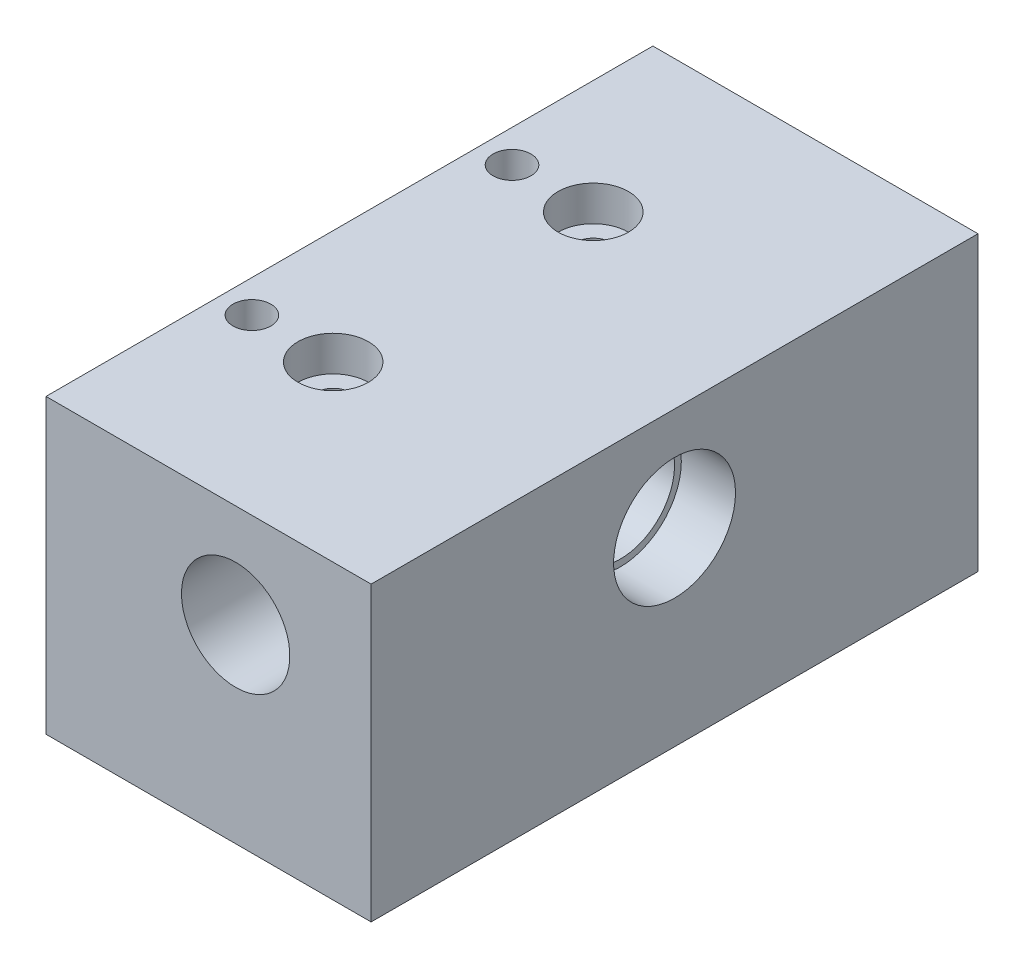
from build123d import *

# Parameters (mm, degrees)
ESQUISSE1_W                                        = 120
ESQUISSE1_H                                        = 108
EXTRUSION1_DEPTH                                   = 112
DIAM_TRE_DU_PER_AGE_M0_15_0_15_1_D                 = 39
DIAM_TRE_DU_PER_AGE_M0_15_0_15_1_DEPTH             = 40
DIAM_TRE_DU_PER_AGE_M0_15_0_15_1_TIP               = 11.716782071
PER_AGE1_D                                         = 40
PER_AGE1_DEPTH                                     = 40
ESQUISSE5_R                                        = 20
ENL_V_MAT_EXTRU_1_DEPTH                            = 197.489185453
CHAMBRAGE_POUR_VIS_T_TE_RONDE_BOMB_E_M_D           = 13
CHAMBRAGE_POUR_VIS_T_TE_RONDE_BOMB_E_M_CBORE_D     = 26
CHAMBRAGE_POUR_VIS_T_TE_RONDE_BOMB_E_M_CBORE_DEPTH = 13
DIAM_TRE_DU_PER_AGE_M14_0_14_1_D                   = 14
DIAM_TRE_DU_PER_AGE_M14_0_14_1_DEPTH               = 78
DIAM_TRE_DU_PER_AGE_M14_0_14_1_TIP                 = 4.206024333
DIAM_TRE_DU_PER_AGE_M12_0_12_1_D                   = 12
ESQUISSE12_R                                       = 20
ENL_V_MAT_EXTRU_2_DEPTH                            = 197.48918551
ESQUISSE13_R                                       = 22.5
ENL_V_MAT_EXTRU_3_DEPTH                            = 20


with BuildPart() as part:
    # Esquisse1 → Extrusion1 (new body)
    with BuildSketch(Plane.XY):
        with Locations((60, 54)):
            Rectangle(ESQUISSE1_W, ESQUISSE1_H)
    extrude(amount=EXTRUSION1_DEPTH)

    # Diam_tre du per_age M0.15 _0.15_1
    with Locations(Plane.ZY):
        with Locations((80, 70)):
            Hole(DIAM_TRE_DU_PER_AGE_M0_15_0_15_1_D / 2, depth=DIAM_TRE_DU_PER_AGE_M0_15_0_15_1_DEPTH)
            with Locations((0, 0, -(DIAM_TRE_DU_PER_AGE_M0_15_0_15_1_DEPTH + DIAM_TRE_DU_PER_AGE_M0_15_0_15_1_TIP / 2))):  # 118° drill point
                Cone(0, DIAM_TRE_DU_PER_AGE_M0_15_0_15_1_D / 2, DIAM_TRE_DU_PER_AGE_M0_15_0_15_1_TIP, mode=Mode.SUBTRACT)

    # Per_age1
    with Locations(Plane(origin=(0, 70, 80), x_dir=(0, 0, -1), z_dir=(-1, 0, 0))):
        with Locations((0, 0)):
            Hole(PER_AGE1_D / 2, depth=PER_AGE1_DEPTH)

    # Esquisse5 → Enl_v. mat.-Extru.1 (cut, through all)
    with BuildSketch(Plane(origin=(0, 0, 0), x_dir=(-1, 0, 0), z_dir=(0, 0, -1))):
        with Locations((-70, 70)):
            Circle(ESQUISSE5_R)
    extrude(amount=-ENL_V_MAT_EXTRU_1_DEPTH, mode=Mode.SUBTRACT)

    # Chambrage pour vis _ t_te ronde bomb_e M (through all)
    with Locations(Plane(origin=(0, 108, 0), x_dir=(-1, 0, 0), z_dir=(0, 1, 0))):
        with Locations((-42, 48)):
            CounterBoreHole(CHAMBRAGE_POUR_VIS_T_TE_RONDE_BOMB_E_M_D / 2, CHAMBRAGE_POUR_VIS_T_TE_RONDE_BOMB_E_M_CBORE_D / 2, CHAMBRAGE_POUR_VIS_T_TE_RONDE_BOMB_E_M_CBORE_DEPTH)

    # Diam_tre du per_age M14.0 _14_1
    with Locations(Plane(origin=(0, 108, 0), x_dir=(-1, 0, 0), z_dir=(0, 1, 0))):
        with Locations((-12, 48)):
            Hole(DIAM_TRE_DU_PER_AGE_M14_0_14_1_D / 2, depth=DIAM_TRE_DU_PER_AGE_M14_0_14_1_DEPTH)
            with Locations((0, 0, -(DIAM_TRE_DU_PER_AGE_M14_0_14_1_DEPTH + DIAM_TRE_DU_PER_AGE_M14_0_14_1_TIP / 2))):  # 118° drill point
                Cone(0, DIAM_TRE_DU_PER_AGE_M14_0_14_1_D / 2, DIAM_TRE_DU_PER_AGE_M14_0_14_1_TIP, mode=Mode.SUBTRACT)

    # Diam_tre du per_age M12.0 _12_1 (through all)
    with Locations(Plane.XZ):
        with Locations((12, 48)):
            Hole(DIAM_TRE_DU_PER_AGE_M12_0_12_1_D / 2)

    # Sym_trie1: part across plane


with BuildPart() as part_1:
    add(part.part)
    add(part.part.mirror(Plane(origin=(0, 108, 0), x_dir=(1, 0, 0), z_dir=(0, 0, -1))))

    # Esquisse12 → Enl_v. mat.-Extru.2 (cut, through all)
    with BuildSketch(Plane.ZY):
        with Locations((0, 70)):
            Circle(ESQUISSE12_R)
    extrude(amount=-ENL_V_MAT_EXTRU_2_DEPTH, mode=Mode.SUBTRACT)

    # Esquisse13 → Enl_v. mat.-Extru.3 (cut)
    with BuildSketch(Plane(origin=(120, 0, 0), x_dir=(0, 0, -1), z_dir=(1, 0, 0))):
        with Locations((0, 70)):
            Circle(ESQUISSE13_R)
    extrude(amount=-ENL_V_MAT_EXTRU_3_DEPTH, mode=Mode.SUBTRACT)


solid = part_1.part
